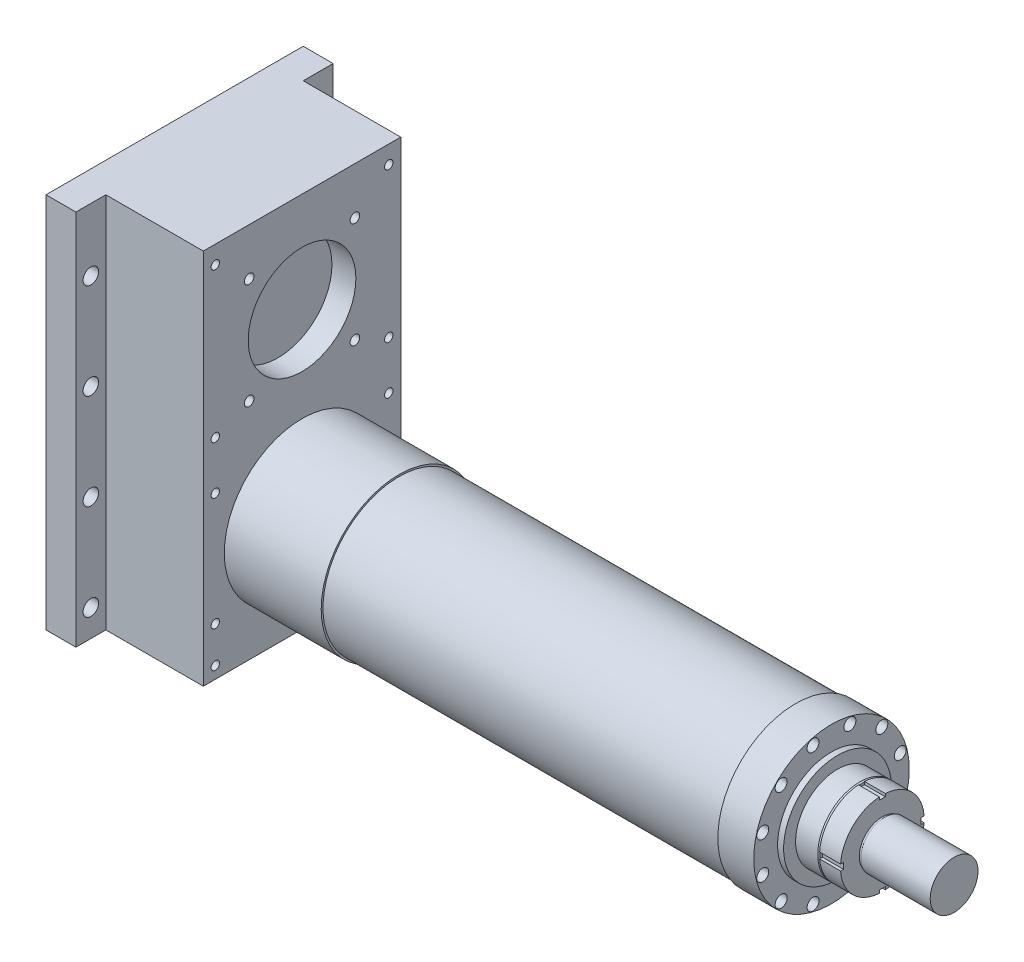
from build123d import *

# Parameters (mm, degrees)
SKETCH_1_R          = 127
SKETCH_1_R_2        = 110
EXTRUDE_1_DEPTH     = 663
SKETCH_2_R          = 130
EXTRUDE_2_DEPTH     = 60
SKETCH_3_R          = 90
EXTRUDE_3_DEPTH     = 10
SKETCH_5_R          = 70
EXTRUDE_4_DEPTH     = 40
CHAMFER_1_SIZE      = 3
CHAMFER_1_SIZE2     = 1.091910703
SKETCH_7_R          = 70
EXTRUDE_5_DEPTH     = 35
SKETCH_8_R          = 38.5
EXTRUDE_6_DEPTH     = 4
SKETCH_9_R          = 40
EXTRUDE_7_DEPTH     = 116
SKETCH_10_W         = 10
SKETCH_10_H         = 12.219318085
SKETCH_10_W_2       = 33.965202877
SKETCH_10_H_2       = 10
SKETCH_10_H_3       = 35.687535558
CUT_EXTRUDE_2_DEPTH = 35
SKETCH_11_R         = 130
EXTRUDE_8_DEPTH     = 162
SKETCH_12_W         = 330
SKETCH_12_H         = 630
EXTRUDE_9_DEPTH     = 163
SKETCH_14_R         = 90
SKETCH_14_R_2       = 8
SKETCH_14_R_3       = 7
CUT_EXTRUDE_3_DEPTH = 40
SKETCH_15_R         = 10
SKETCH_15_R_2       = 6.5
CUT_EXTRUDE_4_DEPTH = 20
SKETCH_15_3_R       = 6.5
CUT_EXTRUDE_5_DEPTH = 50
SKETCH_16_W         = 430
SKETCH_16_H         = 630
SKETCH_16_R         = 13
EXTRUDE_10_DEPTH    = 50


with BuildPart() as part:
    # Sketch 1 → Extrude 1 (new body)
    with BuildSketch(Plane(origin=(0, 0, 0), x_dir=(0, 0, -1), z_dir=(1, 0, 0))):
        Circle(SKETCH_1_R)
        Circle(SKETCH_1_R_2, mode=Mode.SUBTRACT)
    extrude(amount=EXTRUDE_1_DEPTH)


with BuildPart() as body_2:
    # Sketch 2 → Extrude 2 (new body)
    with BuildSketch(Plane(origin=(663, 0, 0), x_dir=(0, 0, -1), z_dir=(1, 0, 0))):
        Circle(SKETCH_2_R)
    extrude(amount=EXTRUDE_2_DEPTH)

    # Sketch 3 → Extrude 3 (add)
    with BuildSketch(Plane(origin=(723, 0, 0), x_dir=(0, 0, -1), z_dir=(1, 0, 0))):
        Circle(SKETCH_3_R)
    extrude(amount=EXTRUDE_3_DEPTH)

    # Sketch 5 → Extrude 4 (add)
    with BuildSketch(Plane(origin=(733, 0, 0), x_dir=(0, 0, -1), z_dir=(1, 0, 0))):
        Circle(SKETCH_5_R)
    extrude(amount=EXTRUDE_4_DEPTH)

    # Chamfer 1
    chamfer_1_edges = [body_2.edges().sort_by_distance(p)[0] for p in [
        (773, 0, 70),
    ]]
    chamfer_1_side = [body_2.faces().sort_by_distance(p)[0] for p in [
        (753, 0, 70),
    ]]
    chamfer(chamfer_1_edges, length=CHAMFER_1_SIZE, length2=CHAMFER_1_SIZE2, reference=chamfer_1_side[0])

    # Sketch 7 → Extrude 5 (add)
    with BuildSketch(Plane(origin=(773, 0, 0), x_dir=(0, 0, -1), z_dir=(1, 0, 0))):
        Circle(SKETCH_7_R)
    extrude(amount=EXTRUDE_5_DEPTH)

    # Sketch 8 → Extrude 6 (add)
    with BuildSketch(Plane(origin=(808, 0, 0), x_dir=(0, 0, -1), z_dir=(1, 0, 0))):
        Circle(SKETCH_8_R)
    extrude(amount=EXTRUDE_6_DEPTH)

    # Sketch 9 → Extrude 7 (add)
    with BuildSketch(Plane(origin=(812, 0, 0), x_dir=(0, 0, -1), z_dir=(1, 0, 0))):
        with Locations(Location((0, 0, 0), (0, 0, 180))):
            Circle(SKETCH_9_R)
    extrude(amount=EXTRUDE_7_DEPTH)

    # Sketch 10 → Cut-Extrude 2 (cut)
    with BuildSketch(Plane(origin=(808, 0, 0), x_dir=(0, 0, -1), z_dir=(1, 0, 0))):
        with Locations((0, -71.109659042)):
            Rectangle(SKETCH_10_W, SKETCH_10_H)
        Polygon((-76.465931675, 5), (-65, 5), (-65, -5), (-79.460488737, -5), align=None)
        with Locations((81.982601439, 0)):
            Rectangle(SKETCH_10_W_2, SKETCH_10_H_2)
        with Locations((0, 82.843767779)):
            Rectangle(SKETCH_10_W, SKETCH_10_H_3)
    extrude(amount=-CUT_EXTRUDE_2_DEPTH, mode=Mode.SUBTRACT)

    # Sketch 15 → Cut-Extrude 4 (cut)
    # profile 1 of 12: a face of its own
    with BuildSketch(Plane(origin=(723, 0, 0), x_dir=(0, 0, -1), z_dir=(1, 0, 0))):
        with Locations((-84.145706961, 84.145706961)):
            Circle(SKETCH_15_R)
        with Locations((-84.145706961, 84.145706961)):
            Circle(SKETCH_15_R_2, mode=Mode.SUBTRACT)
    # profile 2 of 12: a face of its own
    with BuildSketch(Plane(origin=(723, 0, 0), x_dir=(0, 0, -1), z_dir=(1, 0, 0))):
        with Locations((30.799466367, 114.945173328)):
            Circle(SKETCH_15_R)
    # profile 3 of 12: a face of its own
    with BuildSketch(Plane(origin=(723, 0, 0), x_dir=(0, 0, -1), z_dir=(1, 0, 0))):
        with Locations((84.145706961, 84.145706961)):
            Circle(SKETCH_15_R)
    # profile 4 of 12: a face of its own
    with BuildSketch(Plane(origin=(723, 0, 0), x_dir=(0, 0, -1), z_dir=(1, 0, 0))):
        with Locations((-30.799466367, 114.945173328)):
            Circle(SKETCH_15_R)
    # profile 5 of 12: a face of its own
    with BuildSketch(Plane(origin=(723, 0, 0), x_dir=(0, 0, -1), z_dir=(1, 0, 0))):
        with Locations((-114.945173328, 30.799466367)):
            Circle(SKETCH_15_R)
    # profile 6 of 12: a face of its own
    with BuildSketch(Plane(origin=(723, 0, 0), x_dir=(0, 0, -1), z_dir=(1, 0, 0))):
        with Locations((-114.945173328, -30.799466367)):
            Circle(SKETCH_15_R)
    # profile 7 of 12: a face of its own
    with BuildSketch(Plane(origin=(723, 0, 0), x_dir=(0, 0, -1), z_dir=(1, 0, 0))):
        with Locations((-84.145706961, -84.145706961)):
            Circle(SKETCH_15_R)
    # profile 8 of 12: a face of its own
    with BuildSketch(Plane(origin=(723, 0, 0), x_dir=(0, 0, -1), z_dir=(1, 0, 0))):
        with Locations((-30.799466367, -114.945173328)):
            Circle(SKETCH_15_R)
    # profile 9 of 12: a face of its own
    with BuildSketch(Plane(origin=(723, 0, 0), x_dir=(0, 0, -1), z_dir=(1, 0, 0))):
        with Locations((30.799466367, -114.945173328)):
            Circle(SKETCH_15_R)
    # profile 10 of 12: a face of its own
    with BuildSketch(Plane(origin=(723, 0, 0), x_dir=(0, 0, -1), z_dir=(1, 0, 0))):
        with Locations((84.145706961, -84.145706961)):
            Circle(SKETCH_15_R)
    # profile 11 of 12: a face of its own
    with BuildSketch(Plane(origin=(723, 0, 0), x_dir=(0, 0, -1), z_dir=(1, 0, 0))):
        with Locations((114.945173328, -30.799466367)):
            Circle(SKETCH_15_R)
    # profile 12 of 12: a face of its own
    with BuildSketch(Plane(origin=(723, 0, 0), x_dir=(0, 0, -1), z_dir=(1, 0, 0))):
        with Locations((114.945173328, 30.799466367)):
            Circle(SKETCH_15_R)
    extrude(amount=-CUT_EXTRUDE_4_DEPTH, mode=Mode.SUBTRACT)

    # Sketch 15_3 → Cut-Extrude 5 (cut)
    with BuildSketch(Plane(origin=(723, 0, 0), x_dir=(0, 0, -1), z_dir=(1, 0, 0))):
        with Locations((30.799466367, 114.945173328)):
            Circle(SKETCH_15_3_R)
        with Locations((84.145706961, 84.145706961)):
            Circle(SKETCH_15_3_R)
        with Locations((114.945173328, 30.799466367)):
            Circle(SKETCH_15_3_R)
        with Locations((114.945173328, -30.799466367)):
            Circle(SKETCH_15_3_R)
        with Locations((84.145706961, -84.145706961)):
            Circle(SKETCH_15_3_R)
        with Locations((30.799466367, -114.945173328)):
            Circle(SKETCH_15_3_R)
        with Locations((-30.799466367, -114.945173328)):
            Circle(SKETCH_15_3_R)
        with Locations((-84.145706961, -84.145706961)):
            Circle(SKETCH_15_3_R)
        with Locations((-114.945173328, -30.799466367)):
            Circle(SKETCH_15_3_R)
        with Locations((-114.945173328, 30.799466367)):
            Circle(SKETCH_15_3_R)
        with Locations((-84.145706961, 84.145706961)):
            Circle(SKETCH_15_3_R)
        with Locations((-30.799466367, 114.945173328)):
            Circle(SKETCH_15_3_R)
    extrude(amount=-CUT_EXTRUDE_5_DEPTH, mode=Mode.SUBTRACT)


with BuildPart() as body_3:
    # Sketch 11 → Extrude 8 (new body)
    with BuildSketch(Plane.ZY):
        Circle(SKETCH_11_R)
    extrude(amount=EXTRUDE_8_DEPTH)


with BuildPart() as body_4:
    # Sketch 12 → Extrude 9 (new body)
    with BuildSketch(Plane.ZY.offset(162)):
        with Locations((0, 140)):
            Rectangle(SKETCH_12_W, SKETCH_12_H)
    extrude(amount=EXTRUDE_9_DEPTH)

    # Sketch 14 → Cut-Extrude 3 (cut)
    with BuildSketch(Plane(origin=(-162, 0, 0), x_dir=(0, 0, -1), z_dir=(1, 0, 0))):
        with Locations((0, 288)):
            Circle(SKETCH_14_R)
        with Locations((-88.388347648, 376.388347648)):
            Circle(SKETCH_14_R_2)
        with Locations((88.388347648, 376.388347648)):
            Circle(SKETCH_14_R_2)
        with Locations((88.388347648, 199.611652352)):
            Circle(SKETCH_14_R_2)
        with Locations((-88.388347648, 199.611652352)):
            Circle(SKETCH_14_R_2)
        with Locations((-145, 175)):
            Circle(SKETCH_14_R_3)
        with Locations((-145, 94.5)):
            Circle(SKETCH_14_R_3)
        with Locations((-145, -94.5)):
            Circle(SKETCH_14_R_3)
        with Locations((-145, -155)):
            Circle(SKETCH_14_R_3)
        with Locations((-145, 425)):
            Circle(SKETCH_14_R_3)
        with Locations(Location((145, -155, 0), (0, 0, 180))):
            Circle(SKETCH_14_R_3)
        with Locations(Location((145, -94.5, 0), (0, 0, 180))):
            Circle(SKETCH_14_R_3)
        with Locations(Location((145, 94.5, 0), (0, 0, 180))):
            Circle(SKETCH_14_R_3)
        with Locations(Location((145, 175, 0), (0, 0, 180))):
            Circle(SKETCH_14_R_3)
        with Locations(Location((145, 425, 0), (0, 0, 180))):
            Circle(SKETCH_14_R_3)
    extrude(amount=-CUT_EXTRUDE_3_DEPTH, mode=Mode.SUBTRACT)

    # Sketch 16 → Extrude 10 (add)
    with BuildSketch(Plane.ZY.offset(325)):
        with Locations((0, 140)):
            Rectangle(SKETCH_16_W, SKETCH_16_H)
        with Locations((-190, -130)):
            Circle(SKETCH_16_R, mode=Mode.SUBTRACT)
        with Locations((-190, 30)):
            Circle(SKETCH_16_R, mode=Mode.SUBTRACT)
        with Locations((-190, 190)):
            Circle(SKETCH_16_R, mode=Mode.SUBTRACT)
        with Locations((-190, 350)):
            Circle(SKETCH_16_R, mode=Mode.SUBTRACT)
        with Locations(Location((190, -130, 0), (0, 0, 180))):
            Circle(SKETCH_16_R, mode=Mode.SUBTRACT)
        with Locations(Location((190, 30, 0), (0, 0, 180))):
            Circle(SKETCH_16_R, mode=Mode.SUBTRACT)
        with Locations(Location((190, 190, 0), (0, 0, 180))):
            Circle(SKETCH_16_R, mode=Mode.SUBTRACT)
        with Locations(Location((190, 350, 0), (0, 0, 180))):
            Circle(SKETCH_16_R, mode=Mode.SUBTRACT)
    extrude(amount=EXTRUDE_10_DEPTH)


solid = Compound([part.part, body_2.part, body_3.part, body_4.part])
